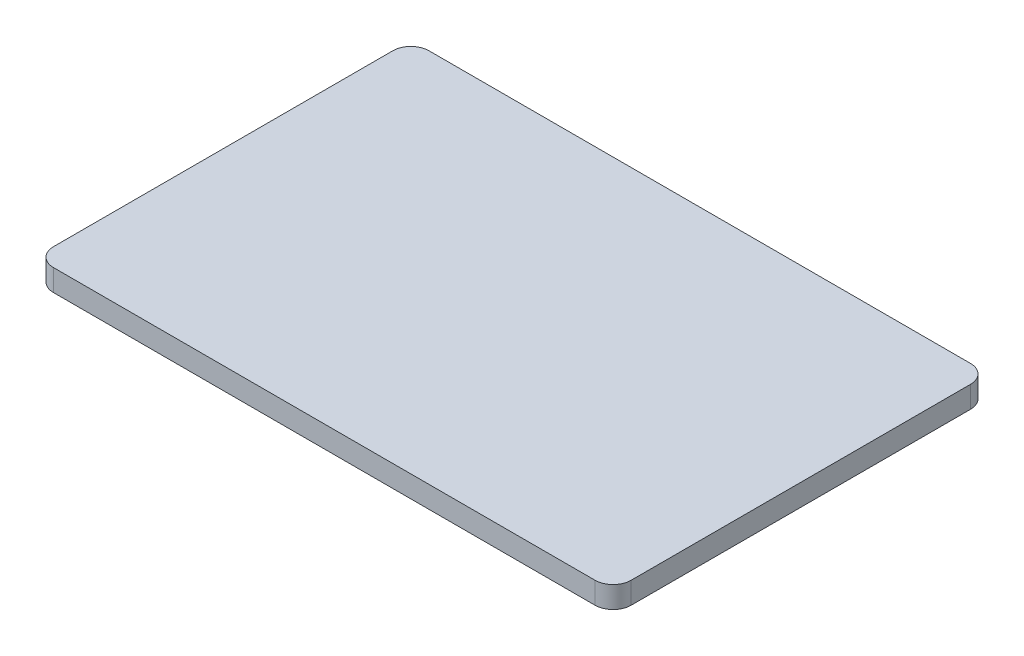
ISO-10303-21;
HEADER;
FILE_DESCRIPTION(('STEP AP214'),'2;1');
FILE_NAME('part.step','',(''),(''),'','','');
FILE_SCHEMA(('AUTOMOTIVE_DESIGN { 1 0 10303 214 1 1 1 1 }'));
ENDSEC;
DATA;
#1=APPLICATION_CONTEXT('core data for automotive mechanical design processes');
#2=APPLICATION_PROTOCOL_DEFINITION('international standard','automotive_design',2000,#1);
#3=PRODUCT_CONTEXT('',#1,'mechanical');
#4=PRODUCT('Part','Part','',(#3));
#5=PRODUCT_RELATED_PRODUCT_CATEGORY('part','',(#4));
#6=PRODUCT_DEFINITION_FORMATION('','',#4);
#7=PRODUCT_DEFINITION_CONTEXT('part definition',#1,'design');
#8=PRODUCT_DEFINITION('design','',#6,#7);
#9=PRODUCT_DEFINITION_SHAPE('','',#8);
#10=(LENGTH_UNIT() NAMED_UNIT(*) SI_UNIT(.MILLI.,.METRE.));
#11=(NAMED_UNIT(*) PLANE_ANGLE_UNIT() SI_UNIT($,.RADIAN.));
#12=(NAMED_UNIT(*) SI_UNIT($,.STERADIAN.) SOLID_ANGLE_UNIT());
#13=UNCERTAINTY_MEASURE_WITH_UNIT(LENGTH_MEASURE(1.E-05),#10,'distance_accuracy_value','');
#14=(GEOMETRIC_REPRESENTATION_CONTEXT(3) GLOBAL_UNCERTAINTY_ASSIGNED_CONTEXT((#13)) GLOBAL_UNIT_ASSIGNED_CONTEXT((#10,
#11,#12)) REPRESENTATION_CONTEXT('',''));
#15=CARTESIAN_POINT('',(0.,0.,0.));
#16=DIRECTION('',(0.,0.,1.));
#17=DIRECTION('',(1.,0.,0.));
#18=AXIS2_PLACEMENT_3D('',#15,#16,#17);
#19=CARTESIAN_POINT('',(-37.5,3.,23.5));
#20=DIRECTION('',(0.,-1.,0.));
#21=DIRECTION('',(0.,0.,-1.));
#22=AXIS2_PLACEMENT_3D('',#19,#20,#21);
#23=CYLINDRICAL_SURFACE('',#22,2.5);
#24=CARTESIAN_POINT('',(-37.5,0.,23.5));
#25=DIRECTION('',(0.,1.,0.));
#26=DIRECTION('',(0.,0.,1.));
#27=AXIS2_PLACEMENT_3D('',#24,#25,#26);
#28=CIRCLE('',#27,2.5);
#29=CARTESIAN_POINT('',(-40.,0.,23.5));
#30=VERTEX_POINT('',#29);
#31=CARTESIAN_POINT('',(-37.5,0.,26.));
#32=VERTEX_POINT('',#31);
#33=EDGE_CURVE('E128',#30,#32,#28,.T.);
#34=ORIENTED_EDGE('',*,*,#33,.T.);
#35=DIRECTION('',(0.,-1.,0.));
#36=VECTOR('',#35,1.);
#37=CARTESIAN_POINT('',(-37.5,3.,26.));
#38=LINE('',#37,#36);
#39=CARTESIAN_POINT('',(-37.5,3.,26.));
#40=VERTEX_POINT('',#39);
#41=EDGE_CURVE('E11',#40,#32,#38,.T.);
#42=ORIENTED_EDGE('',*,*,#41,.F.);
#43=CARTESIAN_POINT('',(-37.5,3.,23.5));
#44=DIRECTION('',(0.,1.,0.));
#45=DIRECTION('',(0.,0.,1.));
#46=AXIS2_PLACEMENT_3D('',#43,#44,#45);
#47=CIRCLE('',#46,2.5);
#48=CARTESIAN_POINT('',(-40.,3.,23.5));
#49=VERTEX_POINT('',#48);
#50=EDGE_CURVE('E142',#49,#40,#47,.T.);
#51=ORIENTED_EDGE('',*,*,#50,.F.);
#52=DIRECTION('',(0.,-1.,0.));
#53=VECTOR('',#52,1.);
#54=CARTESIAN_POINT('',(-40.,3.,23.5));
#55=LINE('',#54,#53);
#56=EDGE_CURVE('E124',#49,#30,#55,.T.);
#57=ORIENTED_EDGE('',*,*,#56,.T.);
#58=EDGE_LOOP('',(#34,#42,#51,#57));
#59=FACE_BOUND('',#58,.T.);
#60=ADVANCED_FACE('F32',(#59),#23,.T.);
#61=CARTESIAN_POINT('',(-37.5,3.,26.));
#62=DIRECTION('',(0.,0.,-1.));
#63=DIRECTION('',(-1.,0.,0.));
#64=AXIS2_PLACEMENT_3D('',#61,#62,#63);
#65=PLANE('',#64);
#66=DIRECTION('',(1.,0.,0.));
#67=VECTOR('',#66,1.);
#68=CARTESIAN_POINT('',(-37.5,0.,26.));
#69=LINE('',#68,#67);
#70=CARTESIAN_POINT('',(37.5,0.,26.));
#71=VERTEX_POINT('',#70);
#72=EDGE_CURVE('E131',#32,#71,#69,.T.);
#73=ORIENTED_EDGE('',*,*,#72,.T.);
#74=DIRECTION('',(0.,-1.,0.));
#75=VECTOR('',#74,1.);
#76=CARTESIAN_POINT('',(37.5,3.,26.));
#77=LINE('',#76,#75);
#78=CARTESIAN_POINT('',(37.5,3.,26.));
#79=VERTEX_POINT('',#78);
#80=EDGE_CURVE('E40',#79,#71,#77,.T.);
#81=ORIENTED_EDGE('',*,*,#80,.F.);
#82=DIRECTION('',(1.,0.,0.));
#83=VECTOR('',#82,1.);
#84=CARTESIAN_POINT('',(-37.5,3.,26.));
#85=LINE('',#84,#83);
#86=EDGE_CURVE('E91',#40,#79,#85,.T.);
#87=ORIENTED_EDGE('',*,*,#86,.F.);
#88=ORIENTED_EDGE('',*,*,#41,.T.);
#89=EDGE_LOOP('',(#73,#81,#87,#88));
#90=FACE_BOUND('',#89,.T.);
#91=ADVANCED_FACE('F177',(#90),#65,.F.);
#92=CARTESIAN_POINT('',(37.5,3.,23.5));
#93=DIRECTION('',(0.,-1.,0.));
#94=DIRECTION('',(0.,0.,-1.));
#95=AXIS2_PLACEMENT_3D('',#92,#93,#94);
#96=CYLINDRICAL_SURFACE('',#95,2.5);
#97=CARTESIAN_POINT('',(37.5,0.,23.5));
#98=DIRECTION('',(0.,1.,0.));
#99=DIRECTION('',(0.,0.,1.));
#100=AXIS2_PLACEMENT_3D('',#97,#98,#99);
#101=CIRCLE('',#100,2.5);
#102=CARTESIAN_POINT('',(40.,0.,23.5));
#103=VERTEX_POINT('',#102);
#104=EDGE_CURVE('E133',#71,#103,#101,.T.);
#105=ORIENTED_EDGE('',*,*,#104,.T.);
#106=DIRECTION('',(0.,-1.,0.));
#107=VECTOR('',#106,1.);
#108=CARTESIAN_POINT('',(40.,3.,23.5));
#109=LINE('',#108,#107);
#110=CARTESIAN_POINT('',(40.,3.,23.5));
#111=VERTEX_POINT('',#110);
#112=EDGE_CURVE('E149',#111,#103,#109,.T.);
#113=ORIENTED_EDGE('',*,*,#112,.F.);
#114=CARTESIAN_POINT('',(37.5,3.,23.5));
#115=DIRECTION('',(0.,1.,0.));
#116=DIRECTION('',(0.,0.,1.));
#117=AXIS2_PLACEMENT_3D('',#114,#115,#116);
#118=CIRCLE('',#117,2.5);
#119=EDGE_CURVE('E157',#79,#111,#118,.T.);
#120=ORIENTED_EDGE('',*,*,#119,.F.);
#121=ORIENTED_EDGE('',*,*,#80,.T.);
#122=EDGE_LOOP('',(#105,#113,#120,#121));
#123=FACE_BOUND('',#122,.T.);
#124=ADVANCED_FACE('F155',(#123),#96,.T.);
#125=CARTESIAN_POINT('',(40.,3.,23.5));
#126=DIRECTION('',(-1.,0.,0.));
#127=DIRECTION('',(0.,0.,1.));
#128=AXIS2_PLACEMENT_3D('',#125,#126,#127);
#129=PLANE('',#128);
#130=DIRECTION('',(0.,0.,-1.));
#131=VECTOR('',#130,1.);
#132=CARTESIAN_POINT('',(40.,0.,23.5));
#133=LINE('',#132,#131);
#134=CARTESIAN_POINT('',(40.,0.,-23.5));
#135=VERTEX_POINT('',#134);
#136=EDGE_CURVE('E135',#103,#135,#133,.T.);
#137=ORIENTED_EDGE('',*,*,#136,.T.);
#138=DIRECTION('',(0.,-1.,0.));
#139=VECTOR('',#138,1.);
#140=CARTESIAN_POINT('',(40.,3.,-23.5));
#141=LINE('',#140,#139);
#142=CARTESIAN_POINT('',(40.,3.,-23.5));
#143=VERTEX_POINT('',#142);
#144=EDGE_CURVE('E146',#143,#135,#141,.T.);
#145=ORIENTED_EDGE('',*,*,#144,.F.);
#146=DIRECTION('',(0.,0.,-1.));
#147=VECTOR('',#146,1.);
#148=CARTESIAN_POINT('',(40.,3.,23.5));
#149=LINE('',#148,#147);
#150=EDGE_CURVE('E169',#111,#143,#149,.T.);
#151=ORIENTED_EDGE('',*,*,#150,.F.);
#152=ORIENTED_EDGE('',*,*,#112,.T.);
#153=EDGE_LOOP('',(#137,#145,#151,#152));
#154=FACE_BOUND('',#153,.T.);
#155=ADVANCED_FACE('F165',(#154),#129,.F.);
#156=CARTESIAN_POINT('',(37.5,3.,-23.5));
#157=DIRECTION('',(0.,-1.,0.));
#158=DIRECTION('',(0.,0.,-1.));
#159=AXIS2_PLACEMENT_3D('',#156,#157,#158);
#160=CYLINDRICAL_SURFACE('',#159,2.5);
#161=CARTESIAN_POINT('',(37.5,0.,-23.5));
#162=DIRECTION('',(0.,1.,0.));
#163=DIRECTION('',(0.,0.,1.));
#164=AXIS2_PLACEMENT_3D('',#161,#162,#163);
#165=CIRCLE('',#164,2.5);
#166=CARTESIAN_POINT('',(37.5,0.,-26.));
#167=VERTEX_POINT('',#166);
#168=EDGE_CURVE('E137',#135,#167,#165,.T.);
#169=ORIENTED_EDGE('',*,*,#168,.T.);
#170=DIRECTION('',(0.,-1.,0.));
#171=VECTOR('',#170,1.);
#172=CARTESIAN_POINT('',(37.5,3.,-26.));
#173=LINE('',#172,#171);
#174=CARTESIAN_POINT('',(37.5,3.,-26.));
#175=VERTEX_POINT('',#174);
#176=EDGE_CURVE('E119',#175,#167,#173,.T.);
#177=ORIENTED_EDGE('',*,*,#176,.F.);
#178=CARTESIAN_POINT('',(37.5,3.,-23.5));
#179=DIRECTION('',(0.,1.,0.));
#180=DIRECTION('',(0.,0.,1.));
#181=AXIS2_PLACEMENT_3D('',#178,#179,#180);
#182=CIRCLE('',#181,2.5);
#183=EDGE_CURVE('E110',#143,#175,#182,.T.);
#184=ORIENTED_EDGE('',*,*,#183,.F.);
#185=ORIENTED_EDGE('',*,*,#144,.T.);
#186=EDGE_LOOP('',(#169,#177,#184,#185));
#187=FACE_BOUND('',#186,.T.);
#188=ADVANCED_FACE('F168',(#187),#160,.T.);
#189=CARTESIAN_POINT('',(-37.5,3.,-26.));
#190=DIRECTION('',(0.,0.,1.));
#191=DIRECTION('',(1.,0.,0.));
#192=AXIS2_PLACEMENT_3D('',#189,#190,#191);
#193=PLANE('',#192);
#194=DIRECTION('',(-1.,0.,0.));
#195=VECTOR('',#194,1.);
#196=CARTESIAN_POINT('',(-37.5,0.,-26.));
#197=LINE('',#196,#195);
#198=CARTESIAN_POINT('',(-37.5,0.,-26.));
#199=VERTEX_POINT('',#198);
#200=EDGE_CURVE('E118',#167,#199,#197,.T.);
#201=ORIENTED_EDGE('',*,*,#200,.T.);
#202=DIRECTION('',(0.,-1.,0.));
#203=VECTOR('',#202,1.);
#204=CARTESIAN_POINT('',(-37.5,3.,-26.));
#205=LINE('',#204,#203);
#206=CARTESIAN_POINT('',(-37.5,3.,-26.));
#207=VERTEX_POINT('',#206);
#208=EDGE_CURVE('E115',#207,#199,#205,.T.);
#209=ORIENTED_EDGE('',*,*,#208,.F.);
#210=DIRECTION('',(-1.,0.,0.));
#211=VECTOR('',#210,1.);
#212=CARTESIAN_POINT('',(-37.5,3.,-26.));
#213=LINE('',#212,#211);
#214=EDGE_CURVE('E104',#175,#207,#213,.T.);
#215=ORIENTED_EDGE('',*,*,#214,.F.);
#216=ORIENTED_EDGE('',*,*,#176,.T.);
#217=EDGE_LOOP('',(#201,#209,#215,#216));
#218=FACE_BOUND('',#217,.T.);
#219=ADVANCED_FACE('F116',(#218),#193,.F.);
#220=CARTESIAN_POINT('',(-37.5,3.,-23.5));
#221=DIRECTION('',(0.,-1.,0.));
#222=DIRECTION('',(0.,0.,-1.));
#223=AXIS2_PLACEMENT_3D('',#220,#221,#222);
#224=CYLINDRICAL_SURFACE('',#223,2.5);
#225=CARTESIAN_POINT('',(-37.5,0.,-23.5));
#226=DIRECTION('',(0.,1.,0.));
#227=DIRECTION('',(0.,0.,1.));
#228=AXIS2_PLACEMENT_3D('',#225,#226,#227);
#229=CIRCLE('',#228,2.5);
#230=CARTESIAN_POINT('',(-40.,0.,-23.5));
#231=VERTEX_POINT('',#230);
#232=EDGE_CURVE('E77',#199,#231,#229,.T.);
#233=ORIENTED_EDGE('',*,*,#232,.T.);
#234=DIRECTION('',(0.,-1.,0.));
#235=VECTOR('',#234,1.);
#236=CARTESIAN_POINT('',(-40.,3.,-23.5));
#237=LINE('',#236,#235);
#238=CARTESIAN_POINT('',(-40.,3.,-23.5));
#239=VERTEX_POINT('',#238);
#240=EDGE_CURVE('E120',#239,#231,#237,.T.);
#241=ORIENTED_EDGE('',*,*,#240,.F.);
#242=CARTESIAN_POINT('',(-37.5,3.,-23.5));
#243=DIRECTION('',(0.,1.,0.));
#244=DIRECTION('',(0.,0.,1.));
#245=AXIS2_PLACEMENT_3D('',#242,#243,#244);
#246=CIRCLE('',#245,2.5);
#247=EDGE_CURVE('E108',#207,#239,#246,.T.);
#248=ORIENTED_EDGE('',*,*,#247,.F.);
#249=ORIENTED_EDGE('',*,*,#208,.T.);
#250=EDGE_LOOP('',(#233,#241,#248,#249));
#251=FACE_BOUND('',#250,.T.);
#252=ADVANCED_FACE('F122',(#251),#224,.T.);
#253=CARTESIAN_POINT('',(-40.,3.,23.5));
#254=DIRECTION('',(1.,0.,0.));
#255=DIRECTION('',(0.,0.,-1.));
#256=AXIS2_PLACEMENT_3D('',#253,#254,#255);
#257=PLANE('',#256);
#258=DIRECTION('',(0.,0.,1.));
#259=VECTOR('',#258,1.);
#260=CARTESIAN_POINT('',(-40.,0.,23.5));
#261=LINE('',#260,#259);
#262=EDGE_CURVE('E83',#231,#30,#261,.T.);
#263=ORIENTED_EDGE('',*,*,#262,.T.);
#264=ORIENTED_EDGE('',*,*,#56,.F.);
#265=DIRECTION('',(0.,0.,1.));
#266=VECTOR('',#265,1.);
#267=CARTESIAN_POINT('',(-40.,3.,23.5));
#268=LINE('',#267,#266);
#269=EDGE_CURVE('E48',#239,#49,#268,.T.);
#270=ORIENTED_EDGE('',*,*,#269,.F.);
#271=ORIENTED_EDGE('',*,*,#240,.T.);
#272=EDGE_LOOP('',(#263,#264,#270,#271));
#273=FACE_BOUND('',#272,.T.);
#274=ADVANCED_FACE('F193',(#273),#257,.F.);
#275=CARTESIAN_POINT('',(-37.5,3.,23.5));
#276=DIRECTION('',(0.,1.,0.));
#277=DIRECTION('',(0.,0.,1.));
#278=AXIS2_PLACEMENT_3D('',#275,#276,#277);
#279=PLANE('',#278);
#280=ORIENTED_EDGE('',*,*,#50,.T.);
#281=ORIENTED_EDGE('',*,*,#86,.T.);
#282=ORIENTED_EDGE('',*,*,#119,.T.);
#283=ORIENTED_EDGE('',*,*,#150,.T.);
#284=ORIENTED_EDGE('',*,*,#183,.T.);
#285=ORIENTED_EDGE('',*,*,#214,.T.);
#286=ORIENTED_EDGE('',*,*,#247,.T.);
#287=ORIENTED_EDGE('',*,*,#269,.T.);
#288=EDGE_LOOP('',(#280,#281,#282,#283,#284,#285,#286,#287));
#289=FACE_BOUND('',#288,.T.);
#290=ADVANCED_FACE('F106',(#289),#279,.T.);
#291=CARTESIAN_POINT('',(-37.5,0.,23.5));
#292=DIRECTION('',(0.,1.,0.));
#293=DIRECTION('',(0.,0.,1.));
#294=AXIS2_PLACEMENT_3D('',#291,#292,#293);
#295=PLANE('',#294);
#296=ORIENTED_EDGE('',*,*,#33,.F.);
#297=ORIENTED_EDGE('',*,*,#262,.F.);
#298=ORIENTED_EDGE('',*,*,#232,.F.);
#299=ORIENTED_EDGE('',*,*,#200,.F.);
#300=ORIENTED_EDGE('',*,*,#168,.F.);
#301=ORIENTED_EDGE('',*,*,#136,.F.);
#302=ORIENTED_EDGE('',*,*,#104,.F.);
#303=ORIENTED_EDGE('',*,*,#72,.F.);
#304=EDGE_LOOP('',(#296,#297,#298,#299,#300,#301,#302,#303));
#305=FACE_BOUND('',#304,.T.);
#306=ADVANCED_FACE('F161',(#305),#295,.F.);
#307=CLOSED_SHELL('',(#60,#91,#124,#155,#188,#219,#252,#274,#290,#306));
#308=MANIFOLD_SOLID_BREP('B2',#307);
#309=ADVANCED_BREP_SHAPE_REPRESENTATION('',(#18,#308),#14);
#310=SHAPE_DEFINITION_REPRESENTATION(#9,#309);
ENDSEC;
END-ISO-10303-21;
